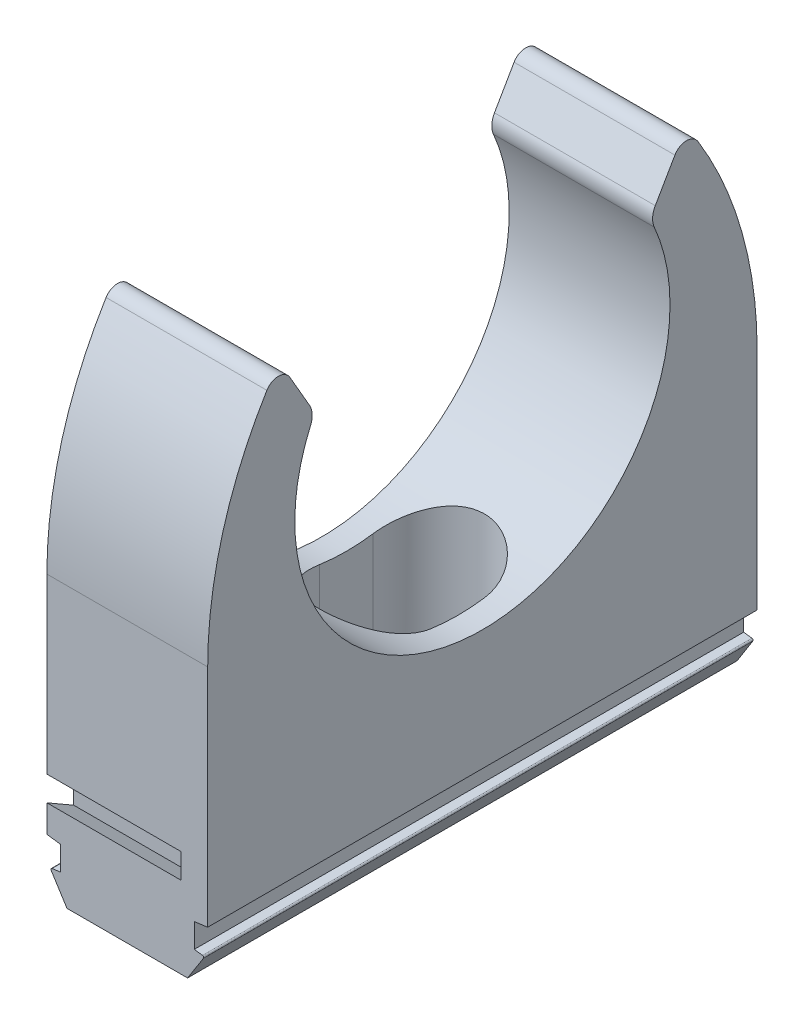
from build123d import *

# Parameters (mm, degrees)
LINEAR_AUSTRAGEN1_DEPTH                     = 6
SCHNITT_LINEAR_AUSTRAGEN6_DEPTH             = 21.5
SCHNITT_LINEAR_AUSTRAGEN7_REACH             = 44.723
SCHNITT_LINEAR_AUSTRAGEN9_REACH             = 36.427
SCHNITT_LINEAR_AUSTRAGEN9_DIRECTION_2_REACH = 36.427
LINEAR_AUSTRAGEN6_DEPTH                     = 10
SCHNITT_LINEAR_AUSTRAGEN10_DEPTH            = 10


with BuildPart() as part:
    # Skizze1 → Linear austragen1 (new, symmetric)
    with BuildSketch(Plane(origin=(0, 0, 0), x_dir=(0, 0, -1), z_dir=(1, 0, 0))):
        with BuildLine():
            Line((20.5, -27), (-20.5, -27))
            Line((-20.5, -27), (-20.5, -6.144689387))
            ThreePointArc((-20.5, -6.144689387), (-19.374935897, 1.99398845), (-16.084128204, 9.522230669))
            ThreePointArc((-16.084128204, 9.522230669), (-15.218391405, 9.999916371), (-14.365298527, 9.5))
            Line((-14.365298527, 9.5), (-12.900961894, 6.963694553))
            ThreePointArc((-12.900961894, 6.963694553), (-12.702314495, 6.296989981), (-12.825806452, 5.612369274))
            ThreePointArc((-12.825806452, 5.612369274), (0, -14), (12.825806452, 5.612369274))
            ThreePointArc((12.825806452, 5.612369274), (12.702314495, 6.296989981), (12.900961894, 6.963694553))
            Line((12.900961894, 6.963694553), (14.365298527, 9.5))
            ThreePointArc((14.365298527, 9.5), (15.218391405, 9.999916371), (16.084128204, 9.522230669))
            ThreePointArc((16.084128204, 9.522230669), (19.374935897, 1.99398845), (20.5, -6.144689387))
            Line((20.5, -6.144689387), (20.5, -27))
        make_face()
    extrude(amount=LINEAR_AUSTRAGEN1_DEPTH, both=True)

    # Skizze11 → Schnitt-Linear austragen6 (cut)
    with BuildSketch(Plane(origin=(0, 0, 0), x_dir=(1, 0, 0), z_dir=(0, 1, 0))):
        with BuildLine():
            Line((-4.15, 2), (-4.15, -2))
            ThreePointArc((-4.15, -2), (0, -6.15), (4.15, -2))
            Line((4.15, -2), (4.15, 2))
            ThreePointArc((4.15, 2), (0, 6.15), (-4.15, 2))
        make_face()
    extrude(amount=-SCHNITT_LINEAR_AUSTRAGEN6_DEPTH, mode=Mode.SUBTRACT)

    # Skizze12 → Schnitt-Linear austragen7 (cut, up to next)
    with BuildSketch(Plane.XZ.offset(27), mode=Mode.PRIVATE) as schnitt_linear_austragen7_sk1:
        with BuildLine():
            Line((-2.5, -1.25), (-2.5, 1.25))
            ThreePointArc((-2.5, 1.25), (0, 3.75), (2.5, 1.25))
            Line((2.5, 1.25), (2.5, -1.25))
            ThreePointArc((2.5, -1.25), (0, -3.75), (-2.5, -1.25))
        make_face()
    schnitt_linear_austragen7_tool1 = extrude(schnitt_linear_austragen7_sk1.sketch, amount=-SCHNITT_LINEAR_AUSTRAGEN7_REACH, mode=Mode.PRIVATE) & part.part
    add(schnitt_linear_austragen7_tool1.solids().sort_by_distance((0, -27, 0))[0], mode=Mode.SUBTRACT)

    # Skizze16 → Schnitt-Linear austragen9 (cut, up to next)
    with BuildSketch(Plane.XY, mode=Mode.PRIVATE) as schnitt_linear_austragen9_sk1:
        with BuildLine():
            Line((6, -27), (6, -22.968347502))
            Line((6, -22.968347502), (5, -23.1))
            Line((5, -23.1), (5, -24.9))
            Line((5, -24.9), (5.613052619, -24.980709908))
            ThreePointArc((5.613052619, -24.980709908), (5.690592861, -25.037511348), (5.684435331, -25.133433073))
            Line((5.684435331, -25.133433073), (4.5, -27))
            Line((4.5, -27), (6, -27))
        make_face()
    schnitt_linear_austragen9_tool1 = extrude(schnitt_linear_austragen9_sk1.sketch, amount=-SCHNITT_LINEAR_AUSTRAGEN9_REACH, mode=Mode.PRIVATE) & part.part
    # Skizze16 → Schnitt-Linear austragen9 (cut, up to next)
    with BuildSketch(Plane.XY, mode=Mode.PRIVATE) as schnitt_linear_austragen9_sk2:
        with BuildLine():
            Line((-6, -22.968347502), (-5, -23.1))
            Line((-5, -23.1), (-5, -24.9))
            Line((-5, -24.9), (-5.613052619, -24.980709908))
            ThreePointArc((-5.613052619, -24.980709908), (-5.690592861, -25.037511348), (-5.684435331, -25.133433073))
            Line((-5.684435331, -25.133433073), (-4.5, -27))
            Line((-4.5, -27), (-6, -27))
            Line((-6, -27), (-6, -22.968347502))
        make_face()
    schnitt_linear_austragen9_tool2 = extrude(schnitt_linear_austragen9_sk2.sketch, amount=-SCHNITT_LINEAR_AUSTRAGEN9_REACH, mode=Mode.PRIVATE) & part.part
    add(schnitt_linear_austragen9_tool1.solids().sort_by_distance((5.128539, -26.089764, 0))[0], mode=Mode.SUBTRACT)
    add(schnitt_linear_austragen9_tool2.solids().sort_by_distance((-5.505615, -23.076822, 0))[0], mode=Mode.SUBTRACT)

    # Skizze16 → Schnitt-Linear austragen9 direction 2 (cut, up to next)
    with BuildSketch(Plane.XY, mode=Mode.PRIVATE) as schnitt_linear_austragen9_direction_2_sk1:
        with BuildLine():
            Line((6, -27), (6, -22.968347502))
            Line((6, -22.968347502), (5, -23.1))
            Line((5, -23.1), (5, -24.9))
            Line((5, -24.9), (5.613052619, -24.980709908))
            ThreePointArc((5.613052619, -24.980709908), (5.690592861, -25.037511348), (5.684435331, -25.133433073))
            Line((5.684435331, -25.133433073), (4.5, -27))
            Line((4.5, -27), (6, -27))
        make_face()
    schnitt_linear_austragen9_direction_2_tool1 = extrude(schnitt_linear_austragen9_direction_2_sk1.sketch, amount=SCHNITT_LINEAR_AUSTRAGEN9_DIRECTION_2_REACH, mode=Mode.PRIVATE) & part.part
    # Skizze16 → Schnitt-Linear austragen9 direction 2 (cut, up to next)
    with BuildSketch(Plane.XY, mode=Mode.PRIVATE) as schnitt_linear_austragen9_direction_2_sk2:
        with BuildLine():
            Line((-6, -22.968347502), (-5, -23.1))
            Line((-5, -23.1), (-5, -24.9))
            Line((-5, -24.9), (-5.613052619, -24.980709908))
            ThreePointArc((-5.613052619, -24.980709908), (-5.690592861, -25.037511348), (-5.684435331, -25.133433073))
            Line((-5.684435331, -25.133433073), (-4.5, -27))
            Line((-4.5, -27), (-6, -27))
            Line((-6, -27), (-6, -22.968347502))
        make_face()
    schnitt_linear_austragen9_direction_2_tool2 = extrude(schnitt_linear_austragen9_direction_2_sk2.sketch, amount=SCHNITT_LINEAR_AUSTRAGEN9_DIRECTION_2_REACH, mode=Mode.PRIVATE) & part.part
    add(schnitt_linear_austragen9_direction_2_tool1.solids().sort_by_distance((5.128539, -26.089764, 0))[0], mode=Mode.SUBTRACT)
    add(schnitt_linear_austragen9_direction_2_tool2.solids().sort_by_distance((-5.505615, -23.076822, 0))[0], mode=Mode.SUBTRACT)

    # Skizze15 → Linear austragen6 (add)
    with BuildSketch(Plane.ZY.offset(6)):
        Polygon((-20.5, -19), (-20.5, -21), (-22.5, -22.154700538), (-22.5, -17.845299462), align=None)
    extrude(amount=-LINEAR_AUSTRAGEN6_DEPTH)

    # Skizze20 → Schnitt-Linear austragen10 (cut)
    with BuildSketch(Plane.ZY.offset(6)):
        Polygon((20.5, -19.073205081), (18.5, -17.918504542), (18.5, -22.081495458), (20.5, -20.926794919), align=None)
    extrude(amount=-SCHNITT_LINEAR_AUSTRAGEN10_DEPTH, mode=Mode.SUBTRACT)


solid = part.part
